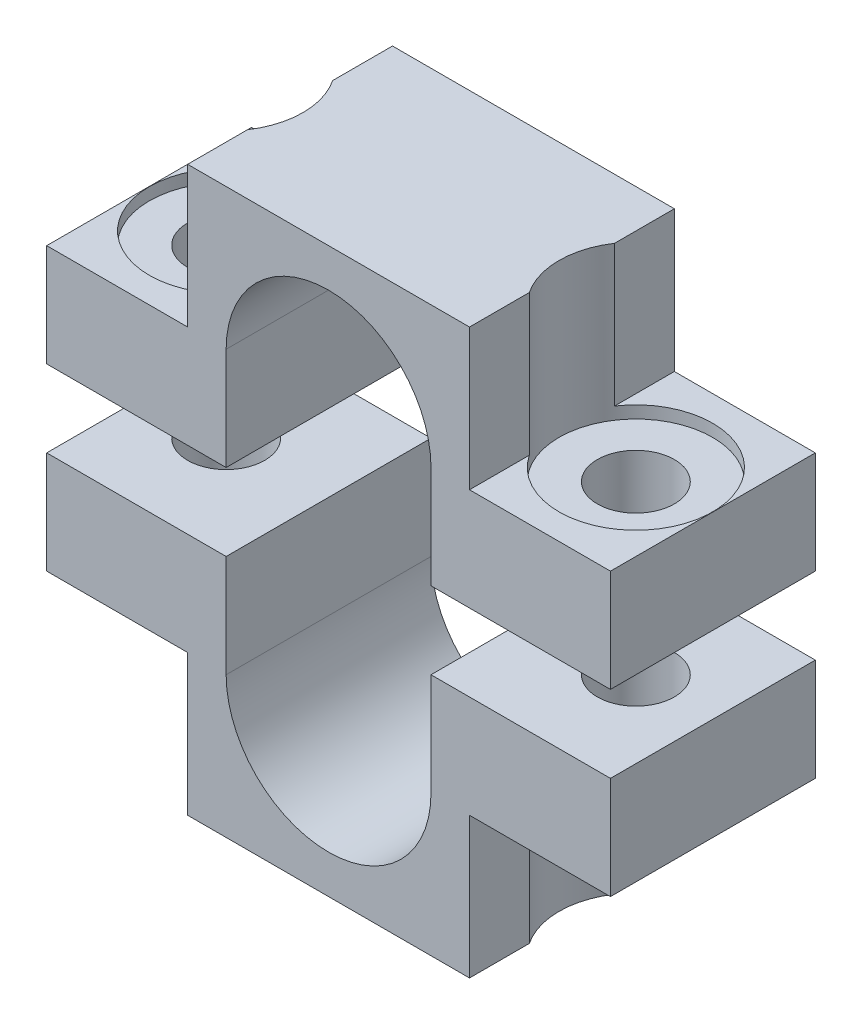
ISO-10303-21;
HEADER;
FILE_DESCRIPTION(('STEP AP214'),'2;1');
FILE_NAME('part.step','',(''),(''),'','','');
FILE_SCHEMA(('AUTOMOTIVE_DESIGN { 1 0 10303 214 1 1 1 1 }'));
ENDSEC;
DATA;
#1=APPLICATION_CONTEXT('core data for automotive mechanical design processes');
#2=APPLICATION_PROTOCOL_DEFINITION('international standard','automotive_design',2000,#1);
#3=PRODUCT_CONTEXT('',#1,'mechanical');
#4=PRODUCT('Part','Part','',(#3));
#5=PRODUCT_RELATED_PRODUCT_CATEGORY('part','',(#4));
#6=PRODUCT_DEFINITION_FORMATION('','',#4);
#7=PRODUCT_DEFINITION_CONTEXT('part definition',#1,'design');
#8=PRODUCT_DEFINITION('design','',#6,#7);
#9=PRODUCT_DEFINITION_SHAPE('','',#8);
#10=(LENGTH_UNIT() NAMED_UNIT(*) SI_UNIT(.MILLI.,.METRE.));
#11=(NAMED_UNIT(*) PLANE_ANGLE_UNIT() SI_UNIT($,.RADIAN.));
#12=(NAMED_UNIT(*) SI_UNIT($,.STERADIAN.) SOLID_ANGLE_UNIT());
#13=UNCERTAINTY_MEASURE_WITH_UNIT(LENGTH_MEASURE(1.E-05),#10,'distance_accuracy_value','');
#14=(GEOMETRIC_REPRESENTATION_CONTEXT(3) GLOBAL_UNCERTAINTY_ASSIGNED_CONTEXT((#13)) GLOBAL_UNIT_ASSIGNED_CONTEXT((#10,
#11,#12)) REPRESENTATION_CONTEXT('',''));
#15=CARTESIAN_POINT('',(0.,0.,0.));
#16=DIRECTION('',(0.,0.,1.));
#17=DIRECTION('',(1.,0.,0.));
#18=AXIS2_PLACEMENT_3D('',#15,#16,#17);
#19=CARTESIAN_POINT('',(8.7376,-17.4752,6.35));
#20=DIRECTION('',(-1.,0.,0.));
#21=DIRECTION('',(0.,1.,0.));
#22=AXIS2_PLACEMENT_3D('',#19,#20,#21);
#23=PLANE('',#22);
#24=DIRECTION('',(0.,0.,-1.));
#25=VECTOR('',#24,1.);
#26=CARTESIAN_POINT('',(8.7376,-17.4752,6.35));
#27=LINE('',#26,#25);
#28=CARTESIAN_POINT('',(8.7376,-17.4752,6.35));
#29=VERTEX_POINT('',#28);
#30=CARTESIAN_POINT('',(8.7376,-17.4752,2.64211893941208));
#31=VERTEX_POINT('',#30);
#32=EDGE_CURVE('E175',#29,#31,#27,.T.);
#33=ORIENTED_EDGE('',*,*,#32,.F.);
#34=DIRECTION('',(0.,-1.,0.));
#35=VECTOR('',#34,1.);
#36=CARTESIAN_POINT('',(8.7376,-17.4752,6.35));
#37=LINE('',#36,#35);
#38=CARTESIAN_POINT('',(8.7376,-26.2128,6.35));
#39=VERTEX_POINT('',#38);
#40=EDGE_CURVE('E171',#29,#39,#37,.T.);
#41=ORIENTED_EDGE('',*,*,#40,.T.);
#42=DIRECTION('',(0.,0.,-1.));
#43=VECTOR('',#42,1.);
#44=CARTESIAN_POINT('',(8.7376,-26.2128,6.35));
#45=LINE('',#44,#43);
#46=CARTESIAN_POINT('',(8.7376,-26.2128,2.64211893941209));
#47=VERTEX_POINT('',#46);
#48=EDGE_CURVE('E156',#39,#47,#45,.T.);
#49=ORIENTED_EDGE('',*,*,#48,.T.);
#50=DIRECTION('',(0.,-1.,0.));
#51=VECTOR('',#50,1.);
#52=CARTESIAN_POINT('',(8.7376,-16.7132,2.64211893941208));
#53=LINE('',#52,#51);
#54=EDGE_CURVE('E161',#31,#47,#53,.T.);
#55=ORIENTED_EDGE('',*,*,#54,.F.);
#56=EDGE_LOOP('',(#33,#41,#49,#55));
#57=FACE_BOUND('',#56,.T.);
#58=ADVANCED_FACE('F42',(#57),#23,.F.);
#59=CARTESIAN_POINT('',(12.7,-22.5552,0.));
#60=DIRECTION('',(0.,1.,0.));
#61=DIRECTION('',(1.,0.,0.));
#62=AXIS2_PLACEMENT_3D('',#59,#60,#61);
#63=CYLINDRICAL_SURFACE('',#62,2.3876);
#64=CARTESIAN_POINT('',(12.7,-11.1252,0.));
#65=DIRECTION('',(0.,1.,0.));
#66=DIRECTION('',(0.,0.,1.));
#67=AXIS2_PLACEMENT_3D('',#64,#65,#66);
#68=CIRCLE('',#67,2.3876);
#69=CARTESIAN_POINT('',(12.7,-11.1252,2.3876));
#70=VERTEX_POINT('',#69);
#71=EDGE_CURVE('E197',#70,#70,#68,.F.);
#72=ORIENTED_EDGE('',*,*,#71,.F.);
#73=EDGE_LOOP('',(#72));
#74=FACE_BOUND('',#73,.T.);
#75=CARTESIAN_POINT('',(12.7,-16.7132,0.));
#76=DIRECTION('',(0.,1.,0.));
#77=DIRECTION('',(-1.,0.,0.));
#78=AXIS2_PLACEMENT_3D('',#75,#76,#77);
#79=CIRCLE('',#78,2.3876);
#80=CARTESIAN_POINT('',(10.3124,-16.7132,0.));
#81=VERTEX_POINT('',#80);
#82=EDGE_CURVE('E205',#81,#81,#79,.T.);
#83=ORIENTED_EDGE('',*,*,#82,.F.);
#84=EDGE_LOOP('',(#83));
#85=FACE_BOUND('',#84,.T.);
#86=ADVANCED_FACE('F328',(#74,#85),#63,.F.);
#87=CARTESIAN_POINT('',(-8.7376,-26.2128,6.35));
#88=DIRECTION('',(1.,0.,0.));
#89=DIRECTION('',(0.,-1.,0.));
#90=AXIS2_PLACEMENT_3D('',#87,#88,#89);
#91=PLANE('',#90);
#92=DIRECTION('',(0.,0.,-1.));
#93=VECTOR('',#92,1.);
#94=CARTESIAN_POINT('',(-8.7376,-17.4752,6.35));
#95=LINE('',#94,#93);
#96=CARTESIAN_POINT('',(-8.7376,-17.4752,-2.64211893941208));
#97=VERTEX_POINT('',#96);
#98=CARTESIAN_POINT('',(-8.7376,-17.4752,-6.35));
#99=VERTEX_POINT('',#98);
#100=EDGE_CURVE('E292',#97,#99,#95,.T.);
#101=ORIENTED_EDGE('',*,*,#100,.T.);
#102=DIRECTION('',(0.,1.,0.));
#103=VECTOR('',#102,1.);
#104=CARTESIAN_POINT('',(-8.7376,-26.2128,-6.35));
#105=LINE('',#104,#103);
#106=CARTESIAN_POINT('',(-8.7376,-26.2128,-6.35));
#107=VERTEX_POINT('',#106);
#108=EDGE_CURVE('E270',#107,#99,#105,.T.);
#109=ORIENTED_EDGE('',*,*,#108,.F.);
#110=DIRECTION('',(0.,0.,-1.));
#111=VECTOR('',#110,1.);
#112=CARTESIAN_POINT('',(-8.7376,-26.2128,6.35));
#113=LINE('',#112,#111);
#114=CARTESIAN_POINT('',(-8.7376,-26.2128,-2.64211893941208));
#115=VERTEX_POINT('',#114);
#116=EDGE_CURVE('E295',#115,#107,#113,.T.);
#117=ORIENTED_EDGE('',*,*,#116,.F.);
#118=DIRECTION('',(0.,-1.,0.));
#119=VECTOR('',#118,1.);
#120=CARTESIAN_POINT('',(-8.7376,-16.7132,-2.64211893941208));
#121=LINE('',#120,#119);
#122=EDGE_CURVE('E50',#97,#115,#121,.T.);
#123=ORIENTED_EDGE('',*,*,#122,.F.);
#124=EDGE_LOOP('',(#101,#109,#117,#123));
#125=FACE_BOUND('',#124,.T.);
#126=ADVANCED_FACE('F304',(#125),#91,.F.);
#127=CARTESIAN_POINT('',(-12.7,-22.5552,0.));
#128=DIRECTION('',(0.,1.,0.));
#129=DIRECTION('',(1.,0.,0.));
#130=AXIS2_PLACEMENT_3D('',#127,#128,#129);
#131=CYLINDRICAL_SURFACE('',#130,2.3876);
#132=CARTESIAN_POINT('',(-12.7,-11.1252,0.));
#133=DIRECTION('',(0.,1.,0.));
#134=DIRECTION('',(0.,0.,1.));
#135=AXIS2_PLACEMENT_3D('',#132,#133,#134);
#136=CIRCLE('',#135,2.3876);
#137=CARTESIAN_POINT('',(-12.7,-11.1252,2.3876));
#138=VERTEX_POINT('',#137);
#139=EDGE_CURVE('E193',#138,#138,#136,.F.);
#140=ORIENTED_EDGE('',*,*,#139,.F.);
#141=EDGE_LOOP('',(#140));
#142=FACE_BOUND('',#141,.T.);
#143=CARTESIAN_POINT('',(-12.7,-16.7132,0.));
#144=DIRECTION('',(0.,1.,0.));
#145=DIRECTION('',(-1.,0.,0.));
#146=AXIS2_PLACEMENT_3D('',#143,#144,#145);
#147=CIRCLE('',#146,2.3876);
#148=CARTESIAN_POINT('',(-15.0876,-16.7132,0.));
#149=VERTEX_POINT('',#148);
#150=EDGE_CURVE('E198',#149,#149,#147,.T.);
#151=ORIENTED_EDGE('',*,*,#150,.F.);
#152=EDGE_LOOP('',(#151));
#153=FACE_BOUND('',#152,.T.);
#154=ADVANCED_FACE('F368',(#142,#153),#131,.F.);
#155=CARTESIAN_POINT('',(6.35,-11.1252,6.35));
#156=DIRECTION('',(0.,-1.,0.));
#157=DIRECTION('',(0.,0.,1.));
#158=AXIS2_PLACEMENT_3D('',#155,#156,#157);
#159=PLANE('',#158);
#160=DIRECTION('',(1.,0.,0.));
#161=VECTOR('',#160,1.);
#162=CARTESIAN_POINT('',(6.35,-11.1252,-6.35));
#163=LINE('',#162,#161);
#164=CARTESIAN_POINT('',(6.35,-11.1252,-6.35));
#165=VERTEX_POINT('',#164);
#166=CARTESIAN_POINT('',(17.4752,-11.1252,-6.35));
#167=VERTEX_POINT('',#166);
#168=EDGE_CURVE('E257',#165,#167,#163,.T.);
#169=ORIENTED_EDGE('',*,*,#168,.F.);
#170=DIRECTION('',(0.,0.,-1.));
#171=VECTOR('',#170,1.);
#172=CARTESIAN_POINT('',(6.35,-11.1252,6.35));
#173=LINE('',#172,#171);
#174=CARTESIAN_POINT('',(6.35,-11.1252,6.35));
#175=VERTEX_POINT('',#174);
#176=EDGE_CURVE('E187',#175,#165,#173,.T.);
#177=ORIENTED_EDGE('',*,*,#176,.F.);
#178=DIRECTION('',(1.,0.,0.));
#179=VECTOR('',#178,1.);
#180=CARTESIAN_POINT('',(6.35,-11.1252,6.35));
#181=LINE('',#180,#179);
#182=CARTESIAN_POINT('',(17.4752,-11.1252,6.35));
#183=VERTEX_POINT('',#182);
#184=EDGE_CURVE('E230',#175,#183,#181,.T.);
#185=ORIENTED_EDGE('',*,*,#184,.T.);
#186=DIRECTION('',(0.,0.,-1.));
#187=VECTOR('',#186,1.);
#188=CARTESIAN_POINT('',(17.4752,-11.1252,6.35));
#189=LINE('',#188,#187);
#190=EDGE_CURVE('E184',#183,#167,#189,.T.);
#191=ORIENTED_EDGE('',*,*,#190,.T.);
#192=EDGE_LOOP('',(#169,#177,#185,#191));
#193=FACE_BOUND('',#192,.T.);
#194=ORIENTED_EDGE('',*,*,#71,.T.);
#195=EDGE_LOOP('',(#194));
#196=FACE_BOUND('',#195,.T.);
#197=ADVANCED_FACE('F372',(#193,#196),#159,.F.);
#198=CARTESIAN_POINT('',(17.4752,-17.4752,6.35));
#199=DIRECTION('',(0.,1.,0.));
#200=DIRECTION('',(1.,0.,0.));
#201=AXIS2_PLACEMENT_3D('',#198,#199,#200);
#202=PLANE('',#201);
#203=CARTESIAN_POINT('',(8.7376,-17.4752,-2.64211893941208));
#204=VERTEX_POINT('',#203);
#205=CARTESIAN_POINT('',(8.7376,-17.4752,-6.35));
#206=VERTEX_POINT('',#205);
#207=EDGE_CURVE('E172',#204,#206,#27,.T.);
#208=ORIENTED_EDGE('',*,*,#207,.T.);
#209=DIRECTION('',(-1.,0.,0.));
#210=VECTOR('',#209,1.);
#211=CARTESIAN_POINT('',(17.4752,-17.4752,-6.35));
#212=LINE('',#211,#210);
#213=CARTESIAN_POINT('',(17.4752,-17.4752,-6.35));
#214=VERTEX_POINT('',#213);
#215=EDGE_CURVE('E262',#214,#206,#212,.T.);
#216=ORIENTED_EDGE('',*,*,#215,.F.);
#217=DIRECTION('',(0.,0.,-1.));
#218=VECTOR('',#217,1.);
#219=CARTESIAN_POINT('',(17.4752,-17.4752,6.35));
#220=LINE('',#219,#218);
#221=CARTESIAN_POINT('',(17.4752,-17.4752,6.35));
#222=VERTEX_POINT('',#221);
#223=EDGE_CURVE('E181',#222,#214,#220,.T.);
#224=ORIENTED_EDGE('',*,*,#223,.F.);
#225=DIRECTION('',(-1.,0.,0.));
#226=VECTOR('',#225,1.);
#227=CARTESIAN_POINT('',(17.4752,-17.4752,6.35));
#228=LINE('',#227,#226);
#229=EDGE_CURVE('E235',#222,#29,#228,.T.);
#230=ORIENTED_EDGE('',*,*,#229,.T.);
#231=ORIENTED_EDGE('',*,*,#32,.T.);
#232=CARTESIAN_POINT('',(12.7,-17.4752,0.));
#233=DIRECTION('',(0.,-1.,0.));
#234=DIRECTION('',(1.,0.,0.));
#235=AXIS2_PLACEMENT_3D('',#232,#233,#234);
#236=CIRCLE('',#235,4.7625);
#237=EDGE_CURVE('E164',#204,#31,#236,.T.);
#238=ORIENTED_EDGE('',*,*,#237,.F.);
#239=EDGE_LOOP('',(#208,#216,#224,#230,#231,#238));
#240=FACE_BOUND('',#239,.T.);
#241=ADVANCED_FACE('F350',(#240),#202,.F.);
#242=CARTESIAN_POINT('',(-8.7376,-17.4752,6.35));
#243=DIRECTION('',(0.,1.,0.));
#244=DIRECTION('',(1.,0.,0.));
#245=AXIS2_PLACEMENT_3D('',#242,#243,#244);
#246=PLANE('',#245);
#247=CARTESIAN_POINT('',(-8.7376,-17.4752,6.35));
#248=VERTEX_POINT('',#247);
#249=CARTESIAN_POINT('',(-8.7376,-17.4752,2.64211893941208));
#250=VERTEX_POINT('',#249);
#251=EDGE_CURVE('E293',#248,#250,#95,.T.);
#252=ORIENTED_EDGE('',*,*,#251,.F.);
#253=DIRECTION('',(-1.,0.,0.));
#254=VECTOR('',#253,1.);
#255=CARTESIAN_POINT('',(-8.7376,-17.4752,6.35));
#256=LINE('',#255,#254);
#257=CARTESIAN_POINT('',(-17.4752,-17.4752,6.35));
#258=VERTEX_POINT('',#257);
#259=EDGE_CURVE('E242',#248,#258,#256,.T.);
#260=ORIENTED_EDGE('',*,*,#259,.T.);
#261=DIRECTION('',(0.,0.,-1.));
#262=VECTOR('',#261,1.);
#263=CARTESIAN_POINT('',(-17.4752,-17.4752,6.35));
#264=LINE('',#263,#262);
#265=CARTESIAN_POINT('',(-17.4752,-17.4752,-6.35));
#266=VERTEX_POINT('',#265);
#267=EDGE_CURVE('E290',#258,#266,#264,.T.);
#268=ORIENTED_EDGE('',*,*,#267,.T.);
#269=DIRECTION('',(-1.,0.,0.));
#270=VECTOR('',#269,1.);
#271=CARTESIAN_POINT('',(-8.7376,-17.4752,-6.35));
#272=LINE('',#271,#270);
#273=EDGE_CURVE('E273',#99,#266,#272,.T.);
#274=ORIENTED_EDGE('',*,*,#273,.F.);
#275=ORIENTED_EDGE('',*,*,#100,.F.);
#276=CARTESIAN_POINT('',(-12.7,-17.4752,0.));
#277=DIRECTION('',(0.,-1.,0.));
#278=DIRECTION('',(1.,0.,0.));
#279=AXIS2_PLACEMENT_3D('',#276,#277,#278);
#280=CIRCLE('',#279,4.7625);
#281=EDGE_CURVE('E220',#250,#97,#280,.T.);
#282=ORIENTED_EDGE('',*,*,#281,.F.);
#283=EDGE_LOOP('',(#252,#260,#268,#274,#275,#282));
#284=FACE_BOUND('',#283,.T.);
#285=ADVANCED_FACE('F307',(#284),#246,.F.);
#286=CARTESIAN_POINT('',(-17.4752,-11.1252,6.35));
#287=DIRECTION('',(0.,-1.,0.));
#288=DIRECTION('',(0.,0.,1.));
#289=AXIS2_PLACEMENT_3D('',#286,#287,#288);
#290=PLANE('',#289);
#291=DIRECTION('',(1.,0.,0.));
#292=VECTOR('',#291,1.);
#293=CARTESIAN_POINT('',(-17.4752,-11.1252,-6.35));
#294=LINE('',#293,#292);
#295=CARTESIAN_POINT('',(-17.4752,-11.1252,-6.35));
#296=VERTEX_POINT('',#295);
#297=CARTESIAN_POINT('',(-6.35,-11.1252,-6.35));
#298=VERTEX_POINT('',#297);
#299=EDGE_CURVE('E278',#296,#298,#294,.T.);
#300=ORIENTED_EDGE('',*,*,#299,.F.);
#301=DIRECTION('',(0.,0.,-1.));
#302=VECTOR('',#301,1.);
#303=CARTESIAN_POINT('',(-17.4752,-11.1252,6.35));
#304=LINE('',#303,#302);
#305=CARTESIAN_POINT('',(-17.4752,-11.1252,6.35));
#306=VERTEX_POINT('',#305);
#307=EDGE_CURVE('E287',#306,#296,#304,.T.);
#308=ORIENTED_EDGE('',*,*,#307,.F.);
#309=DIRECTION('',(1.,0.,0.));
#310=VECTOR('',#309,1.);
#311=CARTESIAN_POINT('',(-17.4752,-11.1252,6.35));
#312=LINE('',#311,#310);
#313=CARTESIAN_POINT('',(-6.35,-11.1252,6.35));
#314=VERTEX_POINT('',#313);
#315=EDGE_CURVE('E247',#306,#314,#312,.T.);
#316=ORIENTED_EDGE('',*,*,#315,.T.);
#317=DIRECTION('',(0.,0.,-1.));
#318=VECTOR('',#317,1.);
#319=CARTESIAN_POINT('',(-6.35,-11.1252,6.35));
#320=LINE('',#319,#318);
#321=EDGE_CURVE('E284',#314,#298,#320,.T.);
#322=ORIENTED_EDGE('',*,*,#321,.T.);
#323=EDGE_LOOP('',(#300,#308,#316,#322));
#324=FACE_BOUND('',#323,.T.);
#325=ORIENTED_EDGE('',*,*,#139,.T.);
#326=EDGE_LOOP('',(#325));
#327=FACE_BOUND('',#326,.T.);
#328=ADVANCED_FACE('F388',(#324,#327),#290,.F.);
#329=CARTESIAN_POINT('',(0.,-17.4752,6.35));
#330=DIRECTION('',(0.,0.,-1.));
#331=DIRECTION('',(-1.,0.,0.));
#332=AXIS2_PLACEMENT_3D('',#329,#330,#331);
#333=CYLINDRICAL_SURFACE('',#332,6.35);
#334=CARTESIAN_POINT('',(0.,-17.4752,-6.35));
#335=DIRECTION('',(0.,0.,1.));
#336=DIRECTION('',(1.,0.,0.));
#337=AXIS2_PLACEMENT_3D('',#334,#335,#336);
#338=CIRCLE('',#337,6.35);
#339=CARTESIAN_POINT('',(-6.35,-17.4752,-6.35));
#340=VERTEX_POINT('',#339);
#341=CARTESIAN_POINT('',(6.35,-17.4752,-6.35));
#342=VERTEX_POINT('',#341);
#343=EDGE_CURVE('E196',#340,#342,#338,.T.);
#344=ORIENTED_EDGE('',*,*,#343,.F.);
#345=DIRECTION('',(0.,0.,-1.));
#346=VECTOR('',#345,1.);
#347=CARTESIAN_POINT('',(-6.35,-17.4752,6.35));
#348=LINE('',#347,#346);
#349=CARTESIAN_POINT('',(-6.35,-17.4752,6.35));
#350=VERTEX_POINT('',#349);
#351=EDGE_CURVE('E252',#350,#340,#348,.T.);
#352=ORIENTED_EDGE('',*,*,#351,.F.);
#353=CARTESIAN_POINT('',(0.,-17.4752,6.35));
#354=DIRECTION('',(0.,0.,1.));
#355=DIRECTION('',(1.,0.,0.));
#356=AXIS2_PLACEMENT_3D('',#353,#354,#355);
#357=CIRCLE('',#356,6.35);
#358=CARTESIAN_POINT('',(6.35,-17.4752,6.35));
#359=VERTEX_POINT('',#358);
#360=EDGE_CURVE('E224',#350,#359,#357,.T.);
#361=ORIENTED_EDGE('',*,*,#360,.T.);
#362=DIRECTION('',(0.,0.,-1.));
#363=VECTOR('',#362,1.);
#364=CARTESIAN_POINT('',(6.35,-17.4752,6.35));
#365=LINE('',#364,#363);
#366=EDGE_CURVE('E190',#359,#342,#365,.T.);
#367=ORIENTED_EDGE('',*,*,#366,.T.);
#368=EDGE_LOOP('',(#344,#352,#361,#367));
#369=FACE_BOUND('',#368,.T.);
#370=ADVANCED_FACE('F44',(#369),#333,.F.);
#371=CARTESIAN_POINT('',(6.35,-17.4752,6.35));
#372=DIRECTION('',(1.,0.,0.));
#373=DIRECTION('',(0.,0.,-1.));
#374=AXIS2_PLACEMENT_3D('',#371,#372,#373);
#375=PLANE('',#374);
#376=DIRECTION('',(0.,1.,0.));
#377=VECTOR('',#376,1.);
#378=CARTESIAN_POINT('',(6.35,-17.4752,-6.35));
#379=LINE('',#378,#377);
#380=EDGE_CURVE('E255',#342,#165,#379,.T.);
#381=ORIENTED_EDGE('',*,*,#380,.F.);
#382=ORIENTED_EDGE('',*,*,#366,.F.);
#383=DIRECTION('',(0.,1.,0.));
#384=VECTOR('',#383,1.);
#385=CARTESIAN_POINT('',(6.35,-17.4752,6.35));
#386=LINE('',#385,#384);
#387=EDGE_CURVE('E227',#359,#175,#386,.T.);
#388=ORIENTED_EDGE('',*,*,#387,.T.);
#389=ORIENTED_EDGE('',*,*,#176,.T.);
#390=EDGE_LOOP('',(#381,#382,#388,#389));
#391=FACE_BOUND('',#390,.T.);
#392=ADVANCED_FACE('F345',(#391),#375,.F.);
#393=CARTESIAN_POINT('',(17.4752,-11.1252,6.35));
#394=DIRECTION('',(-1.,0.,0.));
#395=DIRECTION('',(0.,0.,1.));
#396=AXIS2_PLACEMENT_3D('',#393,#394,#395);
#397=PLANE('',#396);
#398=DIRECTION('',(0.,-1.,0.));
#399=VECTOR('',#398,1.);
#400=CARTESIAN_POINT('',(17.4752,-11.1252,-6.35));
#401=LINE('',#400,#399);
#402=EDGE_CURVE('E260',#167,#214,#401,.T.);
#403=ORIENTED_EDGE('',*,*,#402,.F.);
#404=ORIENTED_EDGE('',*,*,#190,.F.);
#405=DIRECTION('',(0.,-1.,0.));
#406=VECTOR('',#405,1.);
#407=CARTESIAN_POINT('',(17.4752,-11.1252,6.35));
#408=LINE('',#407,#406);
#409=EDGE_CURVE('E233',#183,#222,#408,.T.);
#410=ORIENTED_EDGE('',*,*,#409,.T.);
#411=ORIENTED_EDGE('',*,*,#223,.T.);
#412=EDGE_LOOP('',(#403,#404,#410,#411));
#413=FACE_BOUND('',#412,.T.);
#414=ADVANCED_FACE('F338',(#413),#397,.F.);
#415=CARTESIAN_POINT('',(8.7376,-26.2128,-2.64211893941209));
#416=VERTEX_POINT('',#415);
#417=CARTESIAN_POINT('',(8.7376,-26.2128,-6.35));
#418=VERTEX_POINT('',#417);
#419=EDGE_CURVE('E159',#416,#418,#45,.T.);
#420=ORIENTED_EDGE('',*,*,#419,.T.);
#421=DIRECTION('',(0.,-1.,0.));
#422=VECTOR('',#421,1.);
#423=CARTESIAN_POINT('',(8.7376,-17.4752,-6.35));
#424=LINE('',#423,#422);
#425=EDGE_CURVE('E265',#206,#418,#424,.T.);
#426=ORIENTED_EDGE('',*,*,#425,.F.);
#427=ORIENTED_EDGE('',*,*,#207,.F.);
#428=DIRECTION('',(0.,-1.,0.));
#429=VECTOR('',#428,1.);
#430=CARTESIAN_POINT('',(8.7376,-16.7132,-2.64211893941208));
#431=LINE('',#430,#429);
#432=EDGE_CURVE('E168',#416,#204,#431,.F.);
#433=ORIENTED_EDGE('',*,*,#432,.F.);
#434=EDGE_LOOP('',(#420,#426,#427,#433));
#435=FACE_BOUND('',#434,.T.);
#436=ADVANCED_FACE('F330',(#435),#23,.F.);
#437=CARTESIAN_POINT('',(8.7376,-26.2128,6.35));
#438=DIRECTION('',(0.,1.,0.));
#439=DIRECTION('',(0.,0.,-1.));
#440=AXIS2_PLACEMENT_3D('',#437,#438,#439);
#441=PLANE('',#440);
#442=ORIENTED_EDGE('',*,*,#48,.F.);
#443=DIRECTION('',(-1.,0.,0.));
#444=VECTOR('',#443,1.);
#445=CARTESIAN_POINT('',(8.7376,-26.2128,6.35));
#446=LINE('',#445,#444);
#447=CARTESIAN_POINT('',(-8.7376,-26.2128,6.35));
#448=VERTEX_POINT('',#447);
#449=EDGE_CURVE('E238',#39,#448,#446,.T.);
#450=ORIENTED_EDGE('',*,*,#449,.T.);
#451=CARTESIAN_POINT('',(-8.7376,-26.2128,2.64211893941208));
#452=VERTEX_POINT('',#451);
#453=EDGE_CURVE('E177',#448,#452,#113,.T.);
#454=ORIENTED_EDGE('',*,*,#453,.T.);
#455=CARTESIAN_POINT('',(-12.7,-26.2128,0.));
#456=DIRECTION('',(0.,-1.,0.));
#457=DIRECTION('',(0.,0.,-1.));
#458=AXIS2_PLACEMENT_3D('',#455,#456,#457);
#459=CIRCLE('',#458,4.7625);
#460=EDGE_CURVE('E201',#115,#452,#459,.T.);
#461=ORIENTED_EDGE('',*,*,#460,.F.);
#462=ORIENTED_EDGE('',*,*,#116,.T.);
#463=DIRECTION('',(-1.,0.,0.));
#464=VECTOR('',#463,1.);
#465=CARTESIAN_POINT('',(8.7376,-26.2128,-6.35));
#466=LINE('',#465,#464);
#467=EDGE_CURVE('E268',#418,#107,#466,.T.);
#468=ORIENTED_EDGE('',*,*,#467,.F.);
#469=ORIENTED_EDGE('',*,*,#419,.F.);
#470=CARTESIAN_POINT('',(12.7,-26.2128,0.));
#471=DIRECTION('',(0.,-1.,0.));
#472=DIRECTION('',(0.,0.,-1.));
#473=AXIS2_PLACEMENT_3D('',#470,#471,#472);
#474=CIRCLE('',#473,4.7625);
#475=EDGE_CURVE('E12',#47,#416,#474,.T.);
#476=ORIENTED_EDGE('',*,*,#475,.F.);
#477=EDGE_LOOP('',(#442,#450,#454,#461,#462,#468,#469,#476));
#478=FACE_BOUND('',#477,.T.);
#479=ADVANCED_FACE('F153',(#478),#441,.F.);
#480=ORIENTED_EDGE('',*,*,#453,.F.);
#481=DIRECTION('',(0.,1.,0.));
#482=VECTOR('',#481,1.);
#483=CARTESIAN_POINT('',(-8.7376,-26.2128,6.35));
#484=LINE('',#483,#482);
#485=EDGE_CURVE('E240',#448,#248,#484,.T.);
#486=ORIENTED_EDGE('',*,*,#485,.T.);
#487=ORIENTED_EDGE('',*,*,#251,.T.);
#488=DIRECTION('',(0.,-1.,0.));
#489=VECTOR('',#488,1.);
#490=CARTESIAN_POINT('',(-8.7376,-16.7132,2.64211893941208));
#491=LINE('',#490,#489);
#492=EDGE_CURVE('E63',#452,#250,#491,.F.);
#493=ORIENTED_EDGE('',*,*,#492,.F.);
#494=EDGE_LOOP('',(#480,#486,#487,#493));
#495=FACE_BOUND('',#494,.T.);
#496=ADVANCED_FACE('F344',(#495),#91,.F.);
#497=CARTESIAN_POINT('',(-17.4752,-17.4752,6.35));
#498=DIRECTION('',(1.,0.,0.));
#499=DIRECTION('',(0.,0.,-1.));
#500=AXIS2_PLACEMENT_3D('',#497,#498,#499);
#501=PLANE('',#500);
#502=DIRECTION('',(0.,1.,0.));
#503=VECTOR('',#502,1.);
#504=CARTESIAN_POINT('',(-17.4752,-17.4752,-6.35));
#505=LINE('',#504,#503);
#506=EDGE_CURVE('E276',#266,#296,#505,.T.);
#507=ORIENTED_EDGE('',*,*,#506,.F.);
#508=ORIENTED_EDGE('',*,*,#267,.F.);
#509=DIRECTION('',(0.,1.,0.));
#510=VECTOR('',#509,1.);
#511=CARTESIAN_POINT('',(-17.4752,-17.4752,6.35));
#512=LINE('',#511,#510);
#513=EDGE_CURVE('E245',#258,#306,#512,.T.);
#514=ORIENTED_EDGE('',*,*,#513,.T.);
#515=ORIENTED_EDGE('',*,*,#307,.T.);
#516=EDGE_LOOP('',(#507,#508,#514,#515));
#517=FACE_BOUND('',#516,.T.);
#518=ADVANCED_FACE('F358',(#517),#501,.F.);
#519=CARTESIAN_POINT('',(-6.35,-11.1252,6.35));
#520=DIRECTION('',(-1.,0.,0.));
#521=DIRECTION('',(0.,0.,1.));
#522=AXIS2_PLACEMENT_3D('',#519,#520,#521);
#523=PLANE('',#522);
#524=DIRECTION('',(0.,-1.,0.));
#525=VECTOR('',#524,1.);
#526=CARTESIAN_POINT('',(-6.35,-11.1252,-6.35));
#527=LINE('',#526,#525);
#528=EDGE_CURVE('E228',#298,#340,#527,.T.);
#529=ORIENTED_EDGE('',*,*,#528,.F.);
#530=ORIENTED_EDGE('',*,*,#321,.F.);
#531=DIRECTION('',(0.,-1.,0.));
#532=VECTOR('',#531,1.);
#533=CARTESIAN_POINT('',(-6.35,-11.1252,6.35));
#534=LINE('',#533,#532);
#535=EDGE_CURVE('E250',#314,#350,#534,.T.);
#536=ORIENTED_EDGE('',*,*,#535,.T.);
#537=ORIENTED_EDGE('',*,*,#351,.T.);
#538=EDGE_LOOP('',(#529,#530,#536,#537));
#539=FACE_BOUND('',#538,.T.);
#540=ADVANCED_FACE('F363',(#539),#523,.F.);
#541=CARTESIAN_POINT('',(0.,-17.4752,6.35));
#542=DIRECTION('',(0.,0.,1.));
#543=DIRECTION('',(1.,0.,0.));
#544=AXIS2_PLACEMENT_3D('',#541,#542,#543);
#545=PLANE('',#544);
#546=ORIENTED_EDGE('',*,*,#360,.F.);
#547=ORIENTED_EDGE('',*,*,#535,.F.);
#548=ORIENTED_EDGE('',*,*,#315,.F.);
#549=ORIENTED_EDGE('',*,*,#513,.F.);
#550=ORIENTED_EDGE('',*,*,#259,.F.);
#551=ORIENTED_EDGE('',*,*,#485,.F.);
#552=ORIENTED_EDGE('',*,*,#449,.F.);
#553=ORIENTED_EDGE('',*,*,#40,.F.);
#554=ORIENTED_EDGE('',*,*,#229,.F.);
#555=ORIENTED_EDGE('',*,*,#409,.F.);
#556=ORIENTED_EDGE('',*,*,#184,.F.);
#557=ORIENTED_EDGE('',*,*,#387,.F.);
#558=EDGE_LOOP('',(#546,#547,#548,#549,#550,#551,#552,#553,#554,#555,#556,#557));
#559=FACE_BOUND('',#558,.T.);
#560=ADVANCED_FACE('F324',(#559),#545,.T.);
#561=CARTESIAN_POINT('',(0.,-17.4752,-6.35));
#562=DIRECTION('',(0.,0.,1.));
#563=DIRECTION('',(1.,0.,0.));
#564=AXIS2_PLACEMENT_3D('',#561,#562,#563);
#565=PLANE('',#564);
#566=ORIENTED_EDGE('',*,*,#343,.T.);
#567=ORIENTED_EDGE('',*,*,#380,.T.);
#568=ORIENTED_EDGE('',*,*,#168,.T.);
#569=ORIENTED_EDGE('',*,*,#402,.T.);
#570=ORIENTED_EDGE('',*,*,#215,.T.);
#571=ORIENTED_EDGE('',*,*,#425,.T.);
#572=ORIENTED_EDGE('',*,*,#467,.T.);
#573=ORIENTED_EDGE('',*,*,#108,.T.);
#574=ORIENTED_EDGE('',*,*,#273,.T.);
#575=ORIENTED_EDGE('',*,*,#506,.T.);
#576=ORIENTED_EDGE('',*,*,#299,.T.);
#577=ORIENTED_EDGE('',*,*,#528,.T.);
#578=EDGE_LOOP('',(#566,#567,#568,#569,#570,#571,#572,#573,#574,#575,#576,#577));
#579=FACE_BOUND('',#578,.T.);
#580=ADVANCED_FACE('F310',(#579),#565,.F.);
#581=CARTESIAN_POINT('',(-12.7,-16.7132,0.));
#582=DIRECTION('',(0.,-1.,0.));
#583=DIRECTION('',(-1.,0.,0.));
#584=AXIS2_PLACEMENT_3D('',#581,#582,#583);
#585=CYLINDRICAL_SURFACE('',#584,4.7625);
#586=CARTESIAN_POINT('',(-12.7,-16.7132,0.));
#587=DIRECTION('',(0.,1.,0.));
#588=DIRECTION('',(-1.,0.,0.));
#589=AXIS2_PLACEMENT_3D('',#586,#587,#588);
#590=CIRCLE('',#589,4.7625);
#591=CARTESIAN_POINT('',(-17.4625,-16.7132,0.));
#592=VERTEX_POINT('',#591);
#593=EDGE_CURVE('E202',#592,#592,#590,.T.);
#594=ORIENTED_EDGE('',*,*,#593,.T.);
#595=EDGE_LOOP('',(#594));
#596=FACE_BOUND('',#595,.T.);
#597=ORIENTED_EDGE('',*,*,#281,.T.);
#598=ORIENTED_EDGE('',*,*,#122,.T.);
#599=ORIENTED_EDGE('',*,*,#460,.T.);
#600=ORIENTED_EDGE('',*,*,#492,.T.);
#601=EDGE_LOOP('',(#597,#598,#599,#600));
#602=FACE_BOUND('',#601,.T.);
#603=ADVANCED_FACE('F313',(#596,#602),#585,.F.);
#604=CARTESIAN_POINT('',(-12.7,-16.7132,0.));
#605=DIRECTION('',(0.,-1.,0.));
#606=DIRECTION('',(-1.,0.,0.));
#607=AXIS2_PLACEMENT_3D('',#604,#605,#606);
#608=PLANE('',#607);
#609=ORIENTED_EDGE('',*,*,#150,.T.);
#610=EDGE_LOOP('',(#609));
#611=FACE_BOUND('',#610,.T.);
#612=ORIENTED_EDGE('',*,*,#593,.F.);
#613=EDGE_LOOP('',(#612));
#614=FACE_BOUND('',#613,.T.);
#615=ADVANCED_FACE('F315',(#611,#614),#608,.T.);
#616=CARTESIAN_POINT('',(12.7,-16.7132,0.));
#617=DIRECTION('',(0.,-1.,0.));
#618=DIRECTION('',(-1.,0.,0.));
#619=AXIS2_PLACEMENT_3D('',#616,#617,#618);
#620=CYLINDRICAL_SURFACE('',#619,4.7625);
#621=CARTESIAN_POINT('',(12.7,-16.7132,0.));
#622=DIRECTION('',(0.,1.,0.));
#623=DIRECTION('',(-1.,0.,0.));
#624=AXIS2_PLACEMENT_3D('',#621,#622,#623);
#625=CIRCLE('',#624,4.7625);
#626=CARTESIAN_POINT('',(7.9375,-16.7132,0.));
#627=VERTEX_POINT('',#626);
#628=EDGE_CURVE('E207',#627,#627,#625,.T.);
#629=ORIENTED_EDGE('',*,*,#628,.T.);
#630=EDGE_LOOP('',(#629));
#631=FACE_BOUND('',#630,.T.);
#632=ORIENTED_EDGE('',*,*,#432,.T.);
#633=ORIENTED_EDGE('',*,*,#237,.T.);
#634=ORIENTED_EDGE('',*,*,#54,.T.);
#635=ORIENTED_EDGE('',*,*,#475,.T.);
#636=EDGE_LOOP('',(#632,#633,#634,#635));
#637=FACE_BOUND('',#636,.T.);
#638=ADVANCED_FACE('F162',(#631,#637),#620,.F.);
#639=CARTESIAN_POINT('',(12.7,-16.7132,0.));
#640=DIRECTION('',(0.,-1.,0.));
#641=DIRECTION('',(-1.,0.,0.));
#642=AXIS2_PLACEMENT_3D('',#639,#640,#641);
#643=PLANE('',#642);
#644=ORIENTED_EDGE('',*,*,#82,.T.);
#645=EDGE_LOOP('',(#644));
#646=FACE_BOUND('',#645,.T.);
#647=ORIENTED_EDGE('',*,*,#628,.F.);
#648=EDGE_LOOP('',(#647));
#649=FACE_BOUND('',#648,.T.);
#650=ADVANCED_FACE('F519',(#646,#649),#643,.T.);
#651=CLOSED_SHELL('',(#58,#86,#126,#154,#197,#241,#285,#328,#370,#392,#414,#436,#479,#496,#518,
#540,#560,#580,#603,#615,#638,#650));
#652=MANIFOLD_SOLID_BREP('B2',#651);
#653=CARTESIAN_POINT('',(8.7376,0.,6.35));
#654=DIRECTION('',(-1.,0.,0.));
#655=DIRECTION('',(0.,-1.,0.));
#656=AXIS2_PLACEMENT_3D('',#653,#654,#655);
#657=PLANE('',#656);
#658=DIRECTION('',(0.,0.,-1.));
#659=VECTOR('',#658,1.);
#660=CARTESIAN_POINT('',(8.7376,0.,6.35));
#661=LINE('',#660,#659);
#662=CARTESIAN_POINT('',(8.7376,0.,6.35));
#663=VERTEX_POINT('',#662);
#664=CARTESIAN_POINT('',(8.7376,0.,2.64211893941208));
#665=VERTEX_POINT('',#664);
#666=EDGE_CURVE('E666',#663,#665,#661,.T.);
#667=ORIENTED_EDGE('',*,*,#666,.T.);
#668=DIRECTION('',(0.,1.,0.));
#669=VECTOR('',#668,1.);
#670=CARTESIAN_POINT('',(8.7376,-0.761999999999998,2.64211893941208));
#671=LINE('',#670,#669);
#672=CARTESIAN_POINT('',(8.7376,8.7376,2.64211893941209));
#673=VERTEX_POINT('',#672);
#674=EDGE_CURVE('E654',#665,#673,#671,.T.);
#675=ORIENTED_EDGE('',*,*,#674,.T.);
#676=DIRECTION('',(0.,0.,-1.));
#677=VECTOR('',#676,1.);
#678=CARTESIAN_POINT('',(8.7376,8.7376,6.35));
#679=LINE('',#678,#677);
#680=CARTESIAN_POINT('',(8.7376,8.7376,6.35));
#681=VERTEX_POINT('',#680);
#682=EDGE_CURVE('E663',#681,#673,#679,.T.);
#683=ORIENTED_EDGE('',*,*,#682,.F.);
#684=DIRECTION('',(0.,1.,0.));
#685=VECTOR('',#684,1.);
#686=CARTESIAN_POINT('',(8.7376,0.,6.35));
#687=LINE('',#686,#685);
#688=EDGE_CURVE('E736',#663,#681,#687,.T.);
#689=ORIENTED_EDGE('',*,*,#688,.F.);
#690=EDGE_LOOP('',(#667,#675,#683,#689));
#691=FACE_BOUND('',#690,.T.);
#692=ADVANCED_FACE('F543',(#691),#657,.F.);
#693=CARTESIAN_POINT('',(12.7,5.08,0.));
#694=DIRECTION('',(0.,-1.,0.));
#695=DIRECTION('',(1.,0.,0.));
#696=AXIS2_PLACEMENT_3D('',#693,#694,#695);
#697=CYLINDRICAL_SURFACE('',#696,2.3876);
#698=CARTESIAN_POINT('',(12.7,-6.35,0.));
#699=DIRECTION('',(0.,1.,0.));
#700=DIRECTION('',(0.,0.,1.));
#701=AXIS2_PLACEMENT_3D('',#698,#699,#700);
#702=CIRCLE('',#701,2.3876);
#703=CARTESIAN_POINT('',(12.7,-6.35,2.3876));
#704=VERTEX_POINT('',#703);
#705=EDGE_CURVE('E697',#704,#704,#702,.F.);
#706=ORIENTED_EDGE('',*,*,#705,.T.);
#707=EDGE_LOOP('',(#706));
#708=FACE_BOUND('',#707,.T.);
#709=CARTESIAN_POINT('',(12.7,-0.761999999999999,0.));
#710=DIRECTION('',(0.,1.,0.));
#711=DIRECTION('',(-1.,0.,0.));
#712=AXIS2_PLACEMENT_3D('',#709,#710,#711);
#713=CIRCLE('',#712,2.3876);
#714=CARTESIAN_POINT('',(10.3124,-0.761999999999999,0.));
#715=VERTEX_POINT('',#714);
#716=EDGE_CURVE('E705',#715,#715,#713,.T.);
#717=ORIENTED_EDGE('',*,*,#716,.T.);
#718=EDGE_LOOP('',(#717));
#719=FACE_BOUND('',#718,.T.);
#720=ADVANCED_FACE('F865',(#708,#719),#697,.F.);
#721=CARTESIAN_POINT('',(-8.7376,8.7376,6.35));
#722=DIRECTION('',(1.,0.,0.));
#723=DIRECTION('',(0.,1.,0.));
#724=AXIS2_PLACEMENT_3D('',#721,#722,#723);
#725=PLANE('',#724);
#726=DIRECTION('',(0.,0.,-1.));
#727=VECTOR('',#726,1.);
#728=CARTESIAN_POINT('',(-8.7376,0.,6.35));
#729=LINE('',#728,#727);
#730=CARTESIAN_POINT('',(-8.7376,0.,-2.64211893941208));
#731=VERTEX_POINT('',#730);
#732=CARTESIAN_POINT('',(-8.7376,0.,-6.35));
#733=VERTEX_POINT('',#732);
#734=EDGE_CURVE('E787',#731,#733,#729,.T.);
#735=ORIENTED_EDGE('',*,*,#734,.F.);
#736=DIRECTION('',(0.,1.,0.));
#737=VECTOR('',#736,1.);
#738=CARTESIAN_POINT('',(-8.7376,-0.762000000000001,-2.64211893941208));
#739=LINE('',#738,#737);
#740=CARTESIAN_POINT('',(-8.7376,8.7376,-2.64211893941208));
#741=VERTEX_POINT('',#740);
#742=EDGE_CURVE('E551',#731,#741,#739,.T.);
#743=ORIENTED_EDGE('',*,*,#742,.T.);
#744=DIRECTION('',(0.,0.,-1.));
#745=VECTOR('',#744,1.);
#746=CARTESIAN_POINT('',(-8.7376,8.7376,6.35));
#747=LINE('',#746,#745);
#748=CARTESIAN_POINT('',(-8.7376,8.7376,-6.35));
#749=VERTEX_POINT('',#748);
#750=EDGE_CURVE('E790',#741,#749,#747,.T.);
#751=ORIENTED_EDGE('',*,*,#750,.T.);
#752=DIRECTION('',(0.,-1.,0.));
#753=VECTOR('',#752,1.);
#754=CARTESIAN_POINT('',(-8.7376,8.7376,-6.35));
#755=LINE('',#754,#753);
#756=EDGE_CURVE('E767',#749,#733,#755,.T.);
#757=ORIENTED_EDGE('',*,*,#756,.T.);
#758=EDGE_LOOP('',(#735,#743,#751,#757));
#759=FACE_BOUND('',#758,.T.);
#760=ADVANCED_FACE('F800',(#759),#725,.F.);
#761=CARTESIAN_POINT('',(-12.7,5.08,0.));
#762=DIRECTION('',(0.,-1.,0.));
#763=DIRECTION('',(1.,0.,0.));
#764=AXIS2_PLACEMENT_3D('',#761,#762,#763);
#765=CYLINDRICAL_SURFACE('',#764,2.3876);
#766=CARTESIAN_POINT('',(-12.7,-6.35,0.));
#767=DIRECTION('',(0.,1.,0.));
#768=DIRECTION('',(0.,0.,1.));
#769=AXIS2_PLACEMENT_3D('',#766,#767,#768);
#770=CIRCLE('',#769,2.3876);
#771=CARTESIAN_POINT('',(-12.7,-6.35,2.3876));
#772=VERTEX_POINT('',#771);
#773=EDGE_CURVE('E693',#772,#772,#770,.F.);
#774=ORIENTED_EDGE('',*,*,#773,.T.);
#775=EDGE_LOOP('',(#774));
#776=FACE_BOUND('',#775,.T.);
#777=CARTESIAN_POINT('',(-12.7,-0.762000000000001,0.));
#778=DIRECTION('',(0.,1.,0.));
#779=DIRECTION('',(-1.,0.,0.));
#780=AXIS2_PLACEMENT_3D('',#777,#778,#779);
#781=CIRCLE('',#780,2.3876);
#782=CARTESIAN_POINT('',(-15.0876,-0.762000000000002,0.));
#783=VERTEX_POINT('',#782);
#784=EDGE_CURVE('E698',#783,#783,#781,.T.);
#785=ORIENTED_EDGE('',*,*,#784,.T.);
#786=EDGE_LOOP('',(#785));
#787=FACE_BOUND('',#786,.T.);
#788=ADVANCED_FACE('F885',(#776,#787),#765,.F.);
#789=CARTESIAN_POINT('',(6.35,-6.35,6.35));
#790=DIRECTION('',(0.,1.,0.));
#791=DIRECTION('',(0.,0.,1.));
#792=AXIS2_PLACEMENT_3D('',#789,#790,#791);
#793=PLANE('',#792);
#794=DIRECTION('',(1.,0.,0.));
#795=VECTOR('',#794,1.);
#796=CARTESIAN_POINT('',(6.35,-6.35,-6.35));
#797=LINE('',#796,#795);
#798=CARTESIAN_POINT('',(6.35,-6.35,-6.35));
#799=VERTEX_POINT('',#798);
#800=CARTESIAN_POINT('',(17.4752,-6.35,-6.35));
#801=VERTEX_POINT('',#800);
#802=EDGE_CURVE('E754',#799,#801,#797,.T.);
#803=ORIENTED_EDGE('',*,*,#802,.T.);
#804=DIRECTION('',(0.,0.,-1.));
#805=VECTOR('',#804,1.);
#806=CARTESIAN_POINT('',(17.4752,-6.35,6.35));
#807=LINE('',#806,#805);
#808=CARTESIAN_POINT('',(17.4752,-6.35,6.35));
#809=VERTEX_POINT('',#808);
#810=EDGE_CURVE('E683',#809,#801,#807,.T.);
#811=ORIENTED_EDGE('',*,*,#810,.F.);
#812=DIRECTION('',(1.,0.,0.));
#813=VECTOR('',#812,1.);
#814=CARTESIAN_POINT('',(6.35,-6.35,6.35));
#815=LINE('',#814,#813);
#816=CARTESIAN_POINT('',(6.35,-6.35,6.35));
#817=VERTEX_POINT('',#816);
#818=EDGE_CURVE('E730',#817,#809,#815,.T.);
#819=ORIENTED_EDGE('',*,*,#818,.F.);
#820=DIRECTION('',(0.,0.,-1.));
#821=VECTOR('',#820,1.);
#822=CARTESIAN_POINT('',(6.35,-6.35,6.35));
#823=LINE('',#822,#821);
#824=EDGE_CURVE('E686',#817,#799,#823,.T.);
#825=ORIENTED_EDGE('',*,*,#824,.T.);
#826=EDGE_LOOP('',(#803,#811,#819,#825));
#827=FACE_BOUND('',#826,.T.);
#828=ORIENTED_EDGE('',*,*,#705,.F.);
#829=EDGE_LOOP('',(#828));
#830=FACE_BOUND('',#829,.T.);
#831=ADVANCED_FACE('F843',(#827,#830),#793,.F.);
#832=CARTESIAN_POINT('',(17.4752,0.,6.35));
#833=DIRECTION('',(0.,-1.,0.));
#834=DIRECTION('',(1.,0.,0.));
#835=AXIS2_PLACEMENT_3D('',#832,#833,#834);
#836=PLANE('',#835);
#837=CARTESIAN_POINT('',(8.7376,0.,-2.64211893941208));
#838=VERTEX_POINT('',#837);
#839=CARTESIAN_POINT('',(8.7376,0.,-6.35));
#840=VERTEX_POINT('',#839);
#841=EDGE_CURVE('E672',#838,#840,#661,.T.);
#842=ORIENTED_EDGE('',*,*,#841,.F.);
#843=CARTESIAN_POINT('',(12.7,0.,0.));
#844=DIRECTION('',(0.,-1.,0.));
#845=DIRECTION('',(1.,0.,0.));
#846=AXIS2_PLACEMENT_3D('',#843,#844,#845);
#847=CIRCLE('',#846,4.7625);
#848=EDGE_CURVE('E667',#838,#665,#847,.T.);
#849=ORIENTED_EDGE('',*,*,#848,.T.);
#850=ORIENTED_EDGE('',*,*,#666,.F.);
#851=DIRECTION('',(-1.,0.,0.));
#852=VECTOR('',#851,1.);
#853=CARTESIAN_POINT('',(17.4752,0.,6.35));
#854=LINE('',#853,#852);
#855=CARTESIAN_POINT('',(17.4752,0.,6.35));
#856=VERTEX_POINT('',#855);
#857=EDGE_CURVE('E734',#856,#663,#854,.T.);
#858=ORIENTED_EDGE('',*,*,#857,.F.);
#859=DIRECTION('',(0.,0.,-1.));
#860=VECTOR('',#859,1.);
#861=CARTESIAN_POINT('',(17.4752,0.,6.35));
#862=LINE('',#861,#860);
#863=CARTESIAN_POINT('',(17.4752,0.,-6.35));
#864=VERTEX_POINT('',#863);
#865=EDGE_CURVE('E680',#856,#864,#862,.T.);
#866=ORIENTED_EDGE('',*,*,#865,.T.);
#867=DIRECTION('',(-1.,0.,0.));
#868=VECTOR('',#867,1.);
#869=CARTESIAN_POINT('',(17.4752,0.,-6.35));
#870=LINE('',#869,#868);
#871=EDGE_CURVE('E758',#864,#840,#870,.T.);
#872=ORIENTED_EDGE('',*,*,#871,.T.);
#873=EDGE_LOOP('',(#842,#849,#850,#858,#866,#872));
#874=FACE_BOUND('',#873,.T.);
#875=ADVANCED_FACE('F834',(#874),#836,.F.);
#876=CARTESIAN_POINT('',(-8.7376,0.,6.35));
#877=DIRECTION('',(0.,-1.,0.));
#878=DIRECTION('',(1.,0.,0.));
#879=AXIS2_PLACEMENT_3D('',#876,#877,#878);
#880=PLANE('',#879);
#881=CARTESIAN_POINT('',(-8.7376,0.,6.35));
#882=VERTEX_POINT('',#881);
#883=CARTESIAN_POINT('',(-8.7376,0.,2.64211893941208));
#884=VERTEX_POINT('',#883);
#885=EDGE_CURVE('E788',#882,#884,#729,.T.);
#886=ORIENTED_EDGE('',*,*,#885,.T.);
#887=CARTESIAN_POINT('',(-12.7,0.,0.));
#888=DIRECTION('',(0.,-1.,0.));
#889=DIRECTION('',(1.,0.,0.));
#890=AXIS2_PLACEMENT_3D('',#887,#888,#889);
#891=CIRCLE('',#890,4.7625);
#892=EDGE_CURVE('E565',#884,#731,#891,.T.);
#893=ORIENTED_EDGE('',*,*,#892,.T.);
#894=ORIENTED_EDGE('',*,*,#734,.T.);
#895=DIRECTION('',(-1.,0.,0.));
#896=VECTOR('',#895,1.);
#897=CARTESIAN_POINT('',(-8.7376,0.,-6.35));
#898=LINE('',#897,#896);
#899=CARTESIAN_POINT('',(-17.4752,0.,-6.35));
#900=VERTEX_POINT('',#899);
#901=EDGE_CURVE('E770',#733,#900,#898,.T.);
#902=ORIENTED_EDGE('',*,*,#901,.T.);
#903=DIRECTION('',(0.,0.,-1.));
#904=VECTOR('',#903,1.);
#905=CARTESIAN_POINT('',(-17.4752,0.,6.35));
#906=LINE('',#905,#904);
#907=CARTESIAN_POINT('',(-17.4752,0.,6.35));
#908=VERTEX_POINT('',#907);
#909=EDGE_CURVE('E785',#908,#900,#906,.T.);
#910=ORIENTED_EDGE('',*,*,#909,.F.);
#911=DIRECTION('',(-1.,0.,0.));
#912=VECTOR('',#911,1.);
#913=CARTESIAN_POINT('',(-8.7376,0.,6.35));
#914=LINE('',#913,#912);
#915=EDGE_CURVE('E741',#882,#908,#914,.T.);
#916=ORIENTED_EDGE('',*,*,#915,.F.);
#917=EDGE_LOOP('',(#886,#893,#894,#902,#910,#916));
#918=FACE_BOUND('',#917,.T.);
#919=ADVANCED_FACE('F795',(#918),#880,.F.);
#920=CARTESIAN_POINT('',(-17.4752,-6.35,6.35));
#921=DIRECTION('',(0.,1.,0.));
#922=DIRECTION('',(0.,0.,1.));
#923=AXIS2_PLACEMENT_3D('',#920,#921,#922);
#924=PLANE('',#923);
#925=DIRECTION('',(1.,0.,0.));
#926=VECTOR('',#925,1.);
#927=CARTESIAN_POINT('',(-17.4752,-6.35,-6.35));
#928=LINE('',#927,#926);
#929=CARTESIAN_POINT('',(-17.4752,-6.35,-6.35));
#930=VERTEX_POINT('',#929);
#931=CARTESIAN_POINT('',(-6.35,-6.35,-6.35));
#932=VERTEX_POINT('',#931);
#933=EDGE_CURVE('E774',#930,#932,#928,.T.);
#934=ORIENTED_EDGE('',*,*,#933,.T.);
#935=DIRECTION('',(0.,0.,-1.));
#936=VECTOR('',#935,1.);
#937=CARTESIAN_POINT('',(-6.35,-6.35,6.35));
#938=LINE('',#937,#936);
#939=CARTESIAN_POINT('',(-6.35,-6.35,6.35));
#940=VERTEX_POINT('',#939);
#941=EDGE_CURVE('E779',#940,#932,#938,.T.);
#942=ORIENTED_EDGE('',*,*,#941,.F.);
#943=DIRECTION('',(1.,0.,0.));
#944=VECTOR('',#943,1.);
#945=CARTESIAN_POINT('',(-17.4752,-6.35,6.35));
#946=LINE('',#945,#944);
#947=CARTESIAN_POINT('',(-17.4752,-6.35,6.35));
#948=VERTEX_POINT('',#947);
#949=EDGE_CURVE('E745',#948,#940,#946,.T.);
#950=ORIENTED_EDGE('',*,*,#949,.F.);
#951=DIRECTION('',(0.,0.,-1.));
#952=VECTOR('',#951,1.);
#953=CARTESIAN_POINT('',(-17.4752,-6.35,6.35));
#954=LINE('',#953,#952);
#955=EDGE_CURVE('E782',#948,#930,#954,.T.);
#956=ORIENTED_EDGE('',*,*,#955,.T.);
#957=EDGE_LOOP('',(#934,#942,#950,#956));
#958=FACE_BOUND('',#957,.T.);
#959=ORIENTED_EDGE('',*,*,#773,.F.);
#960=EDGE_LOOP('',(#959));
#961=FACE_BOUND('',#960,.T.);
#962=ADVANCED_FACE('F815',(#958,#961),#924,.F.);
#963=CARTESIAN_POINT('',(0.,0.,6.35));
#964=DIRECTION('',(0.,0.,-1.));
#965=DIRECTION('',(-1.,0.,0.));
#966=AXIS2_PLACEMENT_3D('',#963,#964,#965);
#967=CYLINDRICAL_SURFACE('',#966,6.35);
#968=CARTESIAN_POINT('',(0.,0.,-6.35));
#969=DIRECTION('',(0.,0.,-1.));
#970=DIRECTION('',(1.,0.,0.));
#971=AXIS2_PLACEMENT_3D('',#968,#969,#970);
#972=CIRCLE('',#971,6.35);
#973=CARTESIAN_POINT('',(-6.35,0.,-6.35));
#974=VERTEX_POINT('',#973);
#975=CARTESIAN_POINT('',(6.35,0.,-6.35));
#976=VERTEX_POINT('',#975);
#977=EDGE_CURVE('E696',#974,#976,#972,.T.);
#978=ORIENTED_EDGE('',*,*,#977,.T.);
#979=DIRECTION('',(0.,0.,-1.));
#980=VECTOR('',#979,1.);
#981=CARTESIAN_POINT('',(6.35,0.,6.35));
#982=LINE('',#981,#980);
#983=CARTESIAN_POINT('',(6.35,0.,6.35));
#984=VERTEX_POINT('',#983);
#985=EDGE_CURVE('E689',#984,#976,#982,.T.);
#986=ORIENTED_EDGE('',*,*,#985,.F.);
#987=CARTESIAN_POINT('',(0.,0.,6.35));
#988=DIRECTION('',(0.,0.,-1.));
#989=DIRECTION('',(1.,0.,0.));
#990=AXIS2_PLACEMENT_3D('',#987,#988,#989);
#991=CIRCLE('',#990,6.35);
#992=CARTESIAN_POINT('',(-6.35,0.,6.35));
#993=VERTEX_POINT('',#992);
#994=EDGE_CURVE('E724',#993,#984,#991,.T.);
#995=ORIENTED_EDGE('',*,*,#994,.F.);
#996=DIRECTION('',(0.,0.,-1.));
#997=VECTOR('',#996,1.);
#998=CARTESIAN_POINT('',(-6.35,0.,6.35));
#999=LINE('',#998,#997);
#1000=EDGE_CURVE('E749',#993,#974,#999,.T.);
#1001=ORIENTED_EDGE('',*,*,#1000,.T.);
#1002=EDGE_LOOP('',(#978,#986,#995,#1001));
#1003=FACE_BOUND('',#1002,.T.);
#1004=ADVANCED_FACE('F545',(#1003),#967,.F.);
#1005=CARTESIAN_POINT('',(6.35,0.,6.35));
#1006=DIRECTION('',(1.,0.,0.));
#1007=DIRECTION('',(0.,0.,-1.));
#1008=AXIS2_PLACEMENT_3D('',#1005,#1006,#1007);
#1009=PLANE('',#1008);
#1010=DIRECTION('',(0.,-1.,0.));
#1011=VECTOR('',#1010,1.);
#1012=CARTESIAN_POINT('',(6.35,0.,-6.35));
#1013=LINE('',#1012,#1011);
#1014=EDGE_CURVE('E752',#976,#799,#1013,.T.);
#1015=ORIENTED_EDGE('',*,*,#1014,.T.);
#1016=ORIENTED_EDGE('',*,*,#824,.F.);
#1017=DIRECTION('',(0.,-1.,0.));
#1018=VECTOR('',#1017,1.);
#1019=CARTESIAN_POINT('',(6.35,0.,6.35));
#1020=LINE('',#1019,#1018);
#1021=EDGE_CURVE('E727',#984,#817,#1020,.T.);
#1022=ORIENTED_EDGE('',*,*,#1021,.F.);
#1023=ORIENTED_EDGE('',*,*,#985,.T.);
#1024=EDGE_LOOP('',(#1015,#1016,#1022,#1023));
#1025=FACE_BOUND('',#1024,.T.);
#1026=ADVANCED_FACE('F848',(#1025),#1009,.F.);
#1027=CARTESIAN_POINT('',(17.4752,-6.35,6.35));
#1028=DIRECTION('',(-1.,0.,0.));
#1029=DIRECTION('',(0.,0.,1.));
#1030=AXIS2_PLACEMENT_3D('',#1027,#1028,#1029);
#1031=PLANE('',#1030);
#1032=DIRECTION('',(0.,1.,0.));
#1033=VECTOR('',#1032,1.);
#1034=CARTESIAN_POINT('',(17.4752,-6.35,-6.35));
#1035=LINE('',#1034,#1033);
#1036=EDGE_CURVE('E756',#801,#864,#1035,.T.);
#1037=ORIENTED_EDGE('',*,*,#1036,.T.);
#1038=ORIENTED_EDGE('',*,*,#865,.F.);
#1039=DIRECTION('',(0.,1.,0.));
#1040=VECTOR('',#1039,1.);
#1041=CARTESIAN_POINT('',(17.4752,-6.35,6.35));
#1042=LINE('',#1041,#1040);
#1043=EDGE_CURVE('E732',#809,#856,#1042,.T.);
#1044=ORIENTED_EDGE('',*,*,#1043,.F.);
#1045=ORIENTED_EDGE('',*,*,#810,.T.);
#1046=EDGE_LOOP('',(#1037,#1038,#1044,#1045));
#1047=FACE_BOUND('',#1046,.T.);
#1048=ADVANCED_FACE('F839',(#1047),#1031,.F.);
#1049=CARTESIAN_POINT('',(8.7376,8.7376,-2.64211893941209));
#1050=VERTEX_POINT('',#1049);
#1051=CARTESIAN_POINT('',(8.7376,8.7376,-6.35));
#1052=VERTEX_POINT('',#1051);
#1053=EDGE_CURVE('E673',#1050,#1052,#679,.T.);
#1054=ORIENTED_EDGE('',*,*,#1053,.F.);
#1055=DIRECTION('',(0.,1.,0.));
#1056=VECTOR('',#1055,1.);
#1057=CARTESIAN_POINT('',(8.7376,-0.761999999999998,-2.64211893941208));
#1058=LINE('',#1057,#1056);
#1059=EDGE_CURVE('E558',#1050,#838,#1058,.F.);
#1060=ORIENTED_EDGE('',*,*,#1059,.T.);
#1061=ORIENTED_EDGE('',*,*,#841,.T.);
#1062=DIRECTION('',(0.,1.,0.));
#1063=VECTOR('',#1062,1.);
#1064=CARTESIAN_POINT('',(8.7376,0.,-6.35));
#1065=LINE('',#1064,#1063);
#1066=EDGE_CURVE('E761',#840,#1052,#1065,.T.);
#1067=ORIENTED_EDGE('',*,*,#1066,.T.);
#1068=EDGE_LOOP('',(#1054,#1060,#1061,#1067));
#1069=FACE_BOUND('',#1068,.T.);
#1070=ADVANCED_FACE('F831',(#1069),#657,.F.);
#1071=CARTESIAN_POINT('',(8.7376,8.7376,6.35));
#1072=DIRECTION('',(0.,-1.,0.));
#1073=DIRECTION('',(0.,0.,-1.));
#1074=AXIS2_PLACEMENT_3D('',#1071,#1072,#1073);
#1075=PLANE('',#1074);
#1076=ORIENTED_EDGE('',*,*,#682,.T.);
#1077=CARTESIAN_POINT('',(12.7,8.7376,0.));
#1078=DIRECTION('',(0.,-1.,0.));
#1079=DIRECTION('',(0.,0.,-1.));
#1080=AXIS2_PLACEMENT_3D('',#1077,#1078,#1079);
#1081=CIRCLE('',#1080,4.7625);
#1082=EDGE_CURVE('E40',#673,#1050,#1081,.T.);
#1083=ORIENTED_EDGE('',*,*,#1082,.T.);
#1084=ORIENTED_EDGE('',*,*,#1053,.T.);
#1085=DIRECTION('',(-1.,0.,0.));
#1086=VECTOR('',#1085,1.);
#1087=CARTESIAN_POINT('',(8.7376,8.7376,-6.35));
#1088=LINE('',#1087,#1086);
#1089=EDGE_CURVE('E764',#1052,#749,#1088,.T.);
#1090=ORIENTED_EDGE('',*,*,#1089,.T.);
#1091=ORIENTED_EDGE('',*,*,#750,.F.);
#1092=CARTESIAN_POINT('',(-12.7,8.7376,0.));
#1093=DIRECTION('',(0.,-1.,0.));
#1094=DIRECTION('',(0.,0.,-1.));
#1095=AXIS2_PLACEMENT_3D('',#1092,#1093,#1094);
#1096=CIRCLE('',#1095,4.7625);
#1097=CARTESIAN_POINT('',(-8.7376,8.7376,2.64211893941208));
#1098=VERTEX_POINT('',#1097);
#1099=EDGE_CURVE('E701',#741,#1098,#1096,.T.);
#1100=ORIENTED_EDGE('',*,*,#1099,.T.);
#1101=CARTESIAN_POINT('',(-8.7376,8.7376,6.35));
#1102=VERTEX_POINT('',#1101);
#1103=EDGE_CURVE('E676',#1102,#1098,#747,.T.);
#1104=ORIENTED_EDGE('',*,*,#1103,.F.);
#1105=DIRECTION('',(-1.,0.,0.));
#1106=VECTOR('',#1105,1.);
#1107=CARTESIAN_POINT('',(8.7376,8.7376,6.35));
#1108=LINE('',#1107,#1106);
#1109=EDGE_CURVE('E671',#681,#1102,#1108,.T.);
#1110=ORIENTED_EDGE('',*,*,#1109,.F.);
#1111=EDGE_LOOP('',(#1076,#1083,#1084,#1090,#1091,#1100,#1104,#1110));
#1112=FACE_BOUND('',#1111,.T.);
#1113=ADVANCED_FACE('F669',(#1112),#1075,.F.);
#1114=ORIENTED_EDGE('',*,*,#1103,.T.);
#1115=DIRECTION('',(0.,1.,0.));
#1116=VECTOR('',#1115,1.);
#1117=CARTESIAN_POINT('',(-8.7376,-0.762000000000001,2.64211893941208));
#1118=LINE('',#1117,#1116);
#1119=EDGE_CURVE('E692',#1098,#884,#1118,.F.);
#1120=ORIENTED_EDGE('',*,*,#1119,.T.);
#1121=ORIENTED_EDGE('',*,*,#885,.F.);
#1122=DIRECTION('',(0.,-1.,0.));
#1123=VECTOR('',#1122,1.);
#1124=CARTESIAN_POINT('',(-8.7376,8.7376,6.35));
#1125=LINE('',#1124,#1123);
#1126=EDGE_CURVE('E739',#1102,#882,#1125,.T.);
#1127=ORIENTED_EDGE('',*,*,#1126,.F.);
#1128=EDGE_LOOP('',(#1114,#1120,#1121,#1127));
#1129=FACE_BOUND('',#1128,.T.);
#1130=ADVANCED_FACE('F825',(#1129),#725,.F.);
#1131=CARTESIAN_POINT('',(-17.4752,0.,6.35));
#1132=DIRECTION('',(1.,0.,0.));
#1133=DIRECTION('',(0.,0.,-1.));
#1134=AXIS2_PLACEMENT_3D('',#1131,#1132,#1133);
#1135=PLANE('',#1134);
#1136=DIRECTION('',(0.,-1.,0.));
#1137=VECTOR('',#1136,1.);
#1138=CARTESIAN_POINT('',(-17.4752,0.,-6.35));
#1139=LINE('',#1138,#1137);
#1140=EDGE_CURVE('E772',#900,#930,#1139,.T.);
#1141=ORIENTED_EDGE('',*,*,#1140,.T.);
#1142=ORIENTED_EDGE('',*,*,#955,.F.);
#1143=DIRECTION('',(0.,-1.,0.));
#1144=VECTOR('',#1143,1.);
#1145=CARTESIAN_POINT('',(-17.4752,0.,6.35));
#1146=LINE('',#1145,#1144);
#1147=EDGE_CURVE('E743',#908,#948,#1146,.T.);
#1148=ORIENTED_EDGE('',*,*,#1147,.F.);
#1149=ORIENTED_EDGE('',*,*,#909,.T.);
#1150=EDGE_LOOP('',(#1141,#1142,#1148,#1149));
#1151=FACE_BOUND('',#1150,.T.);
#1152=ADVANCED_FACE('F811',(#1151),#1135,.F.);
#1153=CARTESIAN_POINT('',(-6.35,-6.35,6.35));
#1154=DIRECTION('',(-1.,0.,0.));
#1155=DIRECTION('',(0.,0.,1.));
#1156=AXIS2_PLACEMENT_3D('',#1153,#1154,#1155);
#1157=PLANE('',#1156);
#1158=DIRECTION('',(0.,1.,0.));
#1159=VECTOR('',#1158,1.);
#1160=CARTESIAN_POINT('',(-6.35,-6.35,-6.35));
#1161=LINE('',#1160,#1159);
#1162=EDGE_CURVE('E728',#932,#974,#1161,.T.);
#1163=ORIENTED_EDGE('',*,*,#1162,.T.);
#1164=ORIENTED_EDGE('',*,*,#1000,.F.);
#1165=DIRECTION('',(0.,1.,0.));
#1166=VECTOR('',#1165,1.);
#1167=CARTESIAN_POINT('',(-6.35,-6.35,6.35));
#1168=LINE('',#1167,#1166);
#1169=EDGE_CURVE('E747',#940,#993,#1168,.T.);
#1170=ORIENTED_EDGE('',*,*,#1169,.F.);
#1171=ORIENTED_EDGE('',*,*,#941,.T.);
#1172=EDGE_LOOP('',(#1163,#1164,#1170,#1171));
#1173=FACE_BOUND('',#1172,.T.);
#1174=ADVANCED_FACE('F853',(#1173),#1157,.F.);
#1175=CARTESIAN_POINT('',(0.,0.,6.35));
#1176=DIRECTION('',(0.,0.,1.));
#1177=DIRECTION('',(1.,0.,0.));
#1178=AXIS2_PLACEMENT_3D('',#1175,#1176,#1177);
#1179=PLANE('',#1178);
#1180=ORIENTED_EDGE('',*,*,#994,.T.);
#1181=ORIENTED_EDGE('',*,*,#1021,.T.);
#1182=ORIENTED_EDGE('',*,*,#818,.T.);
#1183=ORIENTED_EDGE('',*,*,#1043,.T.);
#1184=ORIENTED_EDGE('',*,*,#857,.T.);
#1185=ORIENTED_EDGE('',*,*,#688,.T.);
#1186=ORIENTED_EDGE('',*,*,#1109,.T.);
#1187=ORIENTED_EDGE('',*,*,#1126,.T.);
#1188=ORIENTED_EDGE('',*,*,#915,.T.);
#1189=ORIENTED_EDGE('',*,*,#1147,.T.);
#1190=ORIENTED_EDGE('',*,*,#949,.T.);
#1191=ORIENTED_EDGE('',*,*,#1169,.T.);
#1192=EDGE_LOOP('',(#1180,#1181,#1182,#1183,#1184,#1185,#1186,#1187,#1188,#1189,#1190,#1191));
#1193=FACE_BOUND('',#1192,.T.);
#1194=ADVANCED_FACE('F820',(#1193),#1179,.T.);
#1195=CARTESIAN_POINT('',(0.,0.,-6.35));
#1196=DIRECTION('',(0.,0.,1.));
#1197=DIRECTION('',(1.,0.,0.));
#1198=AXIS2_PLACEMENT_3D('',#1195,#1196,#1197);
#1199=PLANE('',#1198);
#1200=ORIENTED_EDGE('',*,*,#977,.F.);
#1201=ORIENTED_EDGE('',*,*,#1162,.F.);
#1202=ORIENTED_EDGE('',*,*,#933,.F.);
#1203=ORIENTED_EDGE('',*,*,#1140,.F.);
#1204=ORIENTED_EDGE('',*,*,#901,.F.);
#1205=ORIENTED_EDGE('',*,*,#756,.F.);
#1206=ORIENTED_EDGE('',*,*,#1089,.F.);
#1207=ORIENTED_EDGE('',*,*,#1066,.F.);
#1208=ORIENTED_EDGE('',*,*,#871,.F.);
#1209=ORIENTED_EDGE('',*,*,#1036,.F.);
#1210=ORIENTED_EDGE('',*,*,#802,.F.);
#1211=ORIENTED_EDGE('',*,*,#1014,.F.);
#1212=EDGE_LOOP('',(#1200,#1201,#1202,#1203,#1204,#1205,#1206,#1207,#1208,#1209,#1210,#1211));
#1213=FACE_BOUND('',#1212,.T.);
#1214=ADVANCED_FACE('F806',(#1213),#1199,.F.);
#1215=CARTESIAN_POINT('',(-12.7,-0.762000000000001,0.));
#1216=DIRECTION('',(0.,1.,0.));
#1217=DIRECTION('',(-1.,0.,0.));
#1218=AXIS2_PLACEMENT_3D('',#1215,#1216,#1217);
#1219=CYLINDRICAL_SURFACE('',#1218,4.7625);
#1220=CARTESIAN_POINT('',(-12.7,-0.762000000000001,0.));
#1221=DIRECTION('',(0.,1.,0.));
#1222=DIRECTION('',(-1.,0.,0.));
#1223=AXIS2_PLACEMENT_3D('',#1220,#1221,#1222);
#1224=CIRCLE('',#1223,4.7625);
#1225=CARTESIAN_POINT('',(-17.4625,-0.762000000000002,0.));
#1226=VERTEX_POINT('',#1225);
#1227=EDGE_CURVE('E702',#1226,#1226,#1224,.T.);
#1228=ORIENTED_EDGE('',*,*,#1227,.F.);
#1229=EDGE_LOOP('',(#1228));
#1230=FACE_BOUND('',#1229,.T.);
#1231=ORIENTED_EDGE('',*,*,#892,.F.);
#1232=ORIENTED_EDGE('',*,*,#1119,.F.);
#1233=ORIENTED_EDGE('',*,*,#1099,.F.);
#1234=ORIENTED_EDGE('',*,*,#742,.F.);
#1235=EDGE_LOOP('',(#1231,#1232,#1233,#1234));
#1236=FACE_BOUND('',#1235,.T.);
#1237=ADVANCED_FACE('F826',(#1230,#1236),#1219,.F.);
#1238=CARTESIAN_POINT('',(-12.7,-0.762000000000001,0.));
#1239=DIRECTION('',(0.,1.,0.));
#1240=DIRECTION('',(-1.,0.,0.));
#1241=AXIS2_PLACEMENT_3D('',#1238,#1239,#1240);
#1242=PLANE('',#1241);
#1243=ORIENTED_EDGE('',*,*,#784,.F.);
#1244=EDGE_LOOP('',(#1243));
#1245=FACE_BOUND('',#1244,.T.);
#1246=ORIENTED_EDGE('',*,*,#1227,.T.);
#1247=EDGE_LOOP('',(#1246));
#1248=FACE_BOUND('',#1247,.T.);
#1249=ADVANCED_FACE('F902',(#1245,#1248),#1242,.T.);
#1250=CARTESIAN_POINT('',(12.7,-0.761999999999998,0.));
#1251=DIRECTION('',(0.,1.,0.));
#1252=DIRECTION('',(-1.,0.,0.));
#1253=AXIS2_PLACEMENT_3D('',#1250,#1251,#1252);
#1254=CYLINDRICAL_SURFACE('',#1253,4.7625);
#1255=CARTESIAN_POINT('',(12.7,-0.761999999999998,0.));
#1256=DIRECTION('',(0.,1.,0.));
#1257=DIRECTION('',(-1.,0.,0.));
#1258=AXIS2_PLACEMENT_3D('',#1255,#1256,#1257);
#1259=CIRCLE('',#1258,4.7625);
#1260=CARTESIAN_POINT('',(7.9375,-0.761999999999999,0.));
#1261=VERTEX_POINT('',#1260);
#1262=EDGE_CURVE('E707',#1261,#1261,#1259,.T.);
#1263=ORIENTED_EDGE('',*,*,#1262,.F.);
#1264=EDGE_LOOP('',(#1263));
#1265=FACE_BOUND('',#1264,.T.);
#1266=ORIENTED_EDGE('',*,*,#1059,.F.);
#1267=ORIENTED_EDGE('',*,*,#1082,.F.);
#1268=ORIENTED_EDGE('',*,*,#674,.F.);
#1269=ORIENTED_EDGE('',*,*,#848,.F.);
#1270=EDGE_LOOP('',(#1266,#1267,#1268,#1269));
#1271=FACE_BOUND('',#1270,.T.);
#1272=ADVANCED_FACE('F653',(#1265,#1271),#1254,.F.);
#1273=CARTESIAN_POINT('',(12.7,-0.761999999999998,0.));
#1274=DIRECTION('',(0.,1.,0.));
#1275=DIRECTION('',(-1.,0.,0.));
#1276=AXIS2_PLACEMENT_3D('',#1273,#1274,#1275);
#1277=PLANE('',#1276);
#1278=ORIENTED_EDGE('',*,*,#716,.F.);
#1279=EDGE_LOOP('',(#1278));
#1280=FACE_BOUND('',#1279,.T.);
#1281=ORIENTED_EDGE('',*,*,#1262,.T.);
#1282=EDGE_LOOP('',(#1281));
#1283=FACE_BOUND('',#1282,.T.);
#1284=ADVANCED_FACE('F913',(#1280,#1283),#1277,.T.);
#1285=CLOSED_SHELL('',(#692,#720,#760,#788,#831,#875,#919,#962,#1004,#1026,#1048,#1070,#1113,
#1130,#1152,#1174,#1194,#1214,#1237,#1249,#1272,#1284));
#1286=MANIFOLD_SOLID_BREP('B6',#1285);
#1287=ADVANCED_BREP_SHAPE_REPRESENTATION('',(#18,#652,#1286),#14);
#1288=SHAPE_DEFINITION_REPRESENTATION(#9,#1287);
ENDSEC;
END-ISO-10303-21;
